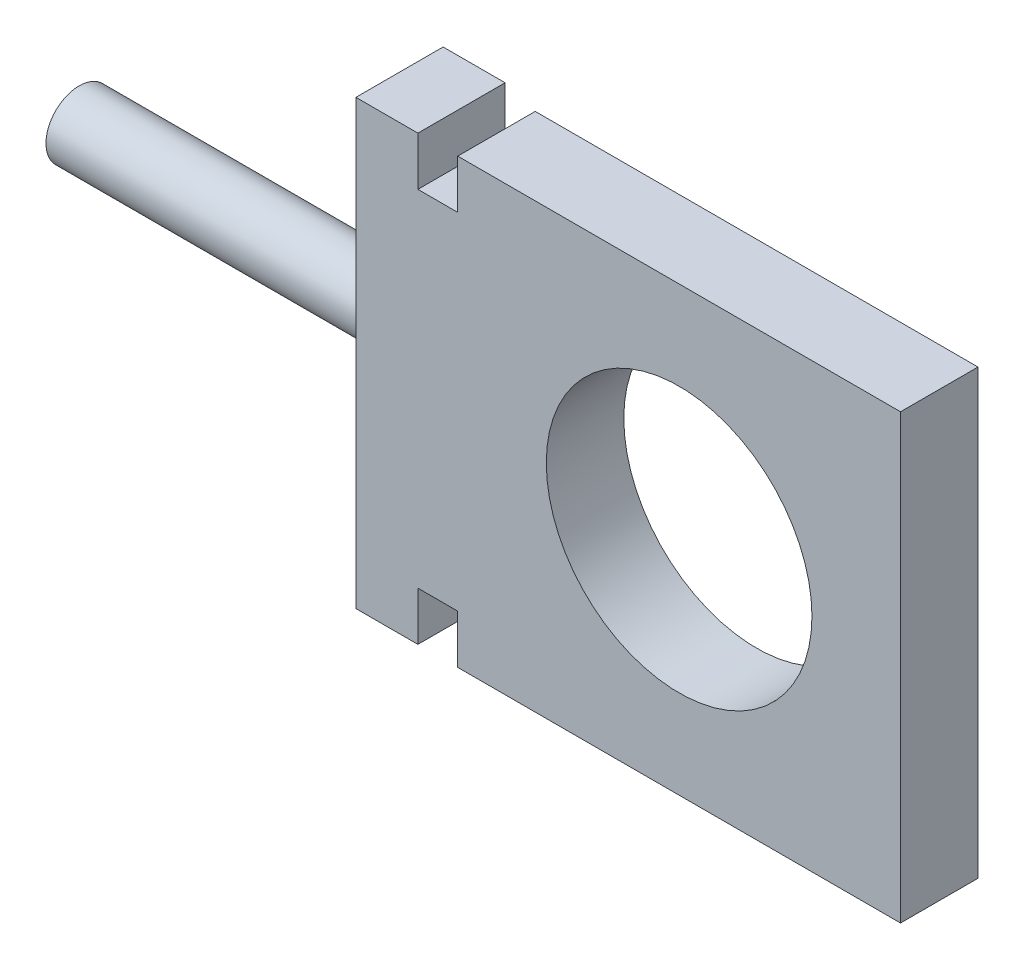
from build123d import *

# Parameters (mm, degrees)
SKETCH1_W           = 127
SKETCH1_H           = 127
BOSS_EXTRUDE1_DEPTH = 22.225
SKETCH2_R           = 38.1
CUT_EXTRUDE1_DEPTH  = 93.511894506
SKETCH3_W           = 99.06
SKETCH3_H           = 12.7
BOSS_EXTRUDE2_DEPTH = 11.43
SKETCH4_W           = 127
SKETCH4_H           = 25.019
BOSS_EXTRUDE3_DEPTH = 17.78
SKETCH5_R           = 9.525
BOSS_EXTRUDE4_DEPTH = 96.52


with BuildPart() as part:
    # Sketch1 → Boss-Extrude1 (new body)
    with BuildSketch(Plane.XY):
        Rectangle(SKETCH1_W, SKETCH1_H)
    extrude(amount=BOSS_EXTRUDE1_DEPTH)

    # Sketch2 → Cut-Extrude1 (cut, through all)
    with BuildSketch(Plane.XY.offset(22.225)):
        Circle(SKETCH2_R)
    extrude(amount=-CUT_EXTRUDE1_DEPTH, mode=Mode.SUBTRACT)

    # Sketch3 → Boss-Extrude2 (add)
    with BuildSketch(Plane(origin=(-63.5, 0, 0), x_dir=(0, -1, 0), z_dir=(1, 0, 0))):
        with Locations((0, -15.875)):
            Rectangle(SKETCH3_W, SKETCH3_H)
    extrude(amount=-BOSS_EXTRUDE2_DEPTH)

    # Sketch4 → Boss-Extrude3 (add)
    with BuildSketch(Plane(origin=(-74.93, 0, 0), x_dir=(0, 1, 0), z_dir=(-1, 0, 0))):
        with Locations((0, -9.7155)):
            Rectangle(SKETCH4_W, SKETCH4_H)
    extrude(amount=BOSS_EXTRUDE3_DEPTH)

    # Sketch5 → Boss-Extrude4 (add)
    with BuildSketch(Plane(origin=(-92.71, 0, 0), x_dir=(0, 1, 0), z_dir=(-1, 0, 0))):
        with Locations(Location((0, -5.08, 0), (0, 0, 55.757831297))):
            Circle(SKETCH5_R)
    extrude(amount=BOSS_EXTRUDE4_DEPTH)


solid = part.part
